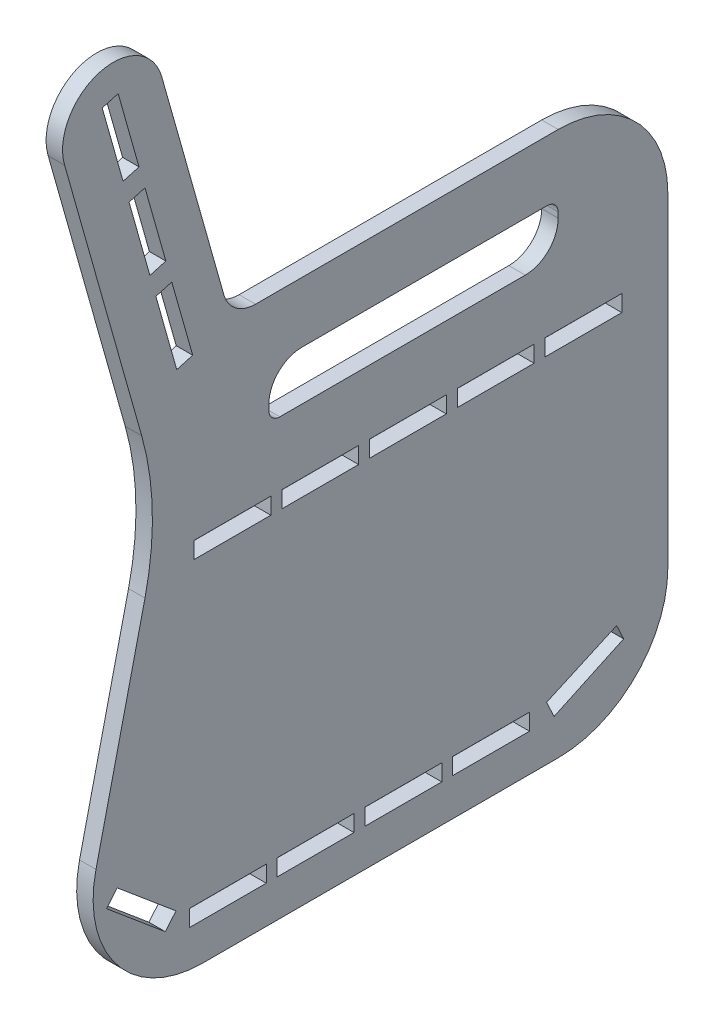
from build123d import *

# Parameters (mm, degrees)
RIGHT_CHAIR_DEPTH      = 7.5
RESPALDO_CUT_DEPTH     = 7.5
RESPALDO_PATTERN_COUNT = 3
RESPALDO_PATTERN_PITCH = 90
SKETCH3_W              = 70
SKETCH3_H              = 15.1
SIT_CUT_DEPTH          = 7.5
SIT_PATTERN_COUNT      = 5
SIT_PATTERN_PITCH      = 80
SKETCH4_W              = 70
SKETCH4_H              = 15.1
BASE_CUT_DEPTH         = 7.5
BASE_PATTERN_COUNT     = 4
BASE_PATTERN_PITCH     = 80
BASE_CUT2_DEPTH        = 7.5
BASE_CUT3_DEPTH        = 7.5


with BuildPart() as part:
    # Sketch1 → right_chair (new, symmetric)
    with BuildSketch(Plane(origin=(0, 0, 0), x_dir=(0, 0, -1), z_dir=(1, 0, 0))):
        with BuildLine():
            Line((40.078252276, -37.155616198), (364.112005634, -37.155616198))
            ThreePointArc((364.112005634, -37.155616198), (434.822683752, -7.866294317), (464.112005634, 62.844383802))
            Line((464.112005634, 62.844383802), (464.112005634, 359.085769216))
            ThreePointArc((464.112005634, 359.085769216), (434.822683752, 429.796447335), (364.112005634, 459.085769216))
            Line((364.112005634, 459.085769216), (88.165465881, 459.085769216))
            ThreePointArc((88.165465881, 459.085769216), (70.063367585, 465.162683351), (59.29492909, 480.931500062))
            Line((59.29492909, 480.931500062), (2.520354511, 681.94429633))
            ThreePointArc((2.520354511, 681.94429633), (-54.750795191, 713.081495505), (-85.887994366, 655.810345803))
            Line((-85.887994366, 655.810345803), (-15.633717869, 407.072091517))
            ThreePointArc((-15.633717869, 407.072091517), (-5.915161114, 342.439951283), (-12.622034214, 277.42624696))
            Line((-12.622034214, 277.42624696), (-57.315210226, 85.52727299))
            ThreePointArc((-57.315210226, 85.52727299), (-38.242526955, 0.668379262), (40.078252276, -37.155616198))
        make_face()
        with BuildLine():
            Line((130.321391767, 403.957901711), (354.112005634, 403.957901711))
            ThreePointArc((354.112005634, 403.957901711), (361.183073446, 401.028969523), (364.112005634, 393.957901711))
            Line((364.112005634, 393.957901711), (364.112005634, 389.085769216))
            ThreePointArc((364.112005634, 389.085769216), (355.325209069, 367.87256578), (334.112005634, 359.085769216))
            Line((334.112005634, 359.085769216), (110.321391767, 359.085769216))
            ThreePointArc((110.321391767, 359.085769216), (103.250323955, 362.014701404), (100.321391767, 369.085769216))
            Line((100.321391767, 369.085769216), (100.321391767, 373.957901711))
            ThreePointArc((100.321391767, 373.957901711), (109.108188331, 395.171105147), (130.321391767, 403.957901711))
        make_face(mode=Mode.SUBTRACT)
    extrude(amount=RIGHT_CHAIR_DEPTH, both=True)

    # Sketch2 → respaldo_cut (cut, symmetric)
    with BuildSketch(Plane(origin=(0, 0, 0), x_dir=(0, 0, -1), z_dir=(1, 0, 0))):
        Polygon((-32.600443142, 616.55433537), (-51.627071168, 683.918921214), (-37.09556765, 688.023236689), (-18.068939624, 620.658650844), align=None)
    respaldo_cut = extrude(amount=RESPALDO_CUT_DEPTH, both=True, mode=Mode.SUBTRACT)

    # respaldo_pattern: respaldo_cut ×3
    with Locations(*[Vector(0, -0.9623512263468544, -0.27180897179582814) * (i * RESPALDO_PATTERN_PITCH) for i in range(1, RESPALDO_PATTERN_COUNT)]):
        add(respaldo_cut, mode=Mode.SUBTRACT)

    # Sketch3 → sit_cut (cut, symmetric)
    with BuildSketch(Plane(origin=(0, 0, 0), x_dir=(0, 0, -1), z_dir=(1, 0, 0))):
        with Locations((67.148374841, 293.011142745)):
            Rectangle(SKETCH3_W, SKETCH3_H)
    sit_cut = extrude(amount=SIT_CUT_DEPTH, both=True, mode=Mode.SUBTRACT)

    # sit_pattern: sit_cut ×5
    with Locations(*[(0, 0, -i * SIT_PATTERN_PITCH) for i in range(1, SIT_PATTERN_COUNT)]):
        add(sit_cut, mode=Mode.SUBTRACT)

    # Sketch4 → base_cut (cut, symmetric)
    with BuildSketch(Plane(origin=(0, 0, 0), x_dir=(0, 0, -1), z_dir=(1, 0, 0))):
        with Locations((62.970463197, 4.50728325)):
            Rectangle(SKETCH4_W, SKETCH4_H)
    base_cut = extrude(amount=BASE_CUT_DEPTH, both=True, mode=Mode.SUBTRACT)

    # base_pattern: base_cut ×4
    with Locations(*[(0, 0, -i * BASE_PATTERN_PITCH) for i in range(1, BASE_PATTERN_COUNT)]):
        add(base_cut, mode=Mode.SUBTRACT)

    # Sketch5 → base_cut2 (cut, symmetric)
    with BuildSketch(Plane(origin=(0, 0, 0), x_dir=(0, 0, -1), z_dir=(1, 0, 0))):
        Polygon((-37.981705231, 61.268866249), (15.641405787, 16.27373357), (5.935312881, 4.706462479), (-47.687798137, 49.701595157), align=None)
    extrude(amount=BASE_CUT2_DEPTH, both=True, mode=Mode.SUBTRACT)

    # Sketch6 → base_cut3 (cut, symmetric)
    with BuildSketch(Plane(origin=(0, 0, 0), x_dir=(0, 0, -1), z_dir=(1, 0, 0))):
        Polygon((353.55832524, 11.997378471), (417.416015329, 40.671328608), (423.804024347, 26.989101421), (360.362479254, -2.594176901), align=None)
    extrude(amount=BASE_CUT3_DEPTH, both=True, mode=Mode.SUBTRACT)


solid = part.part
